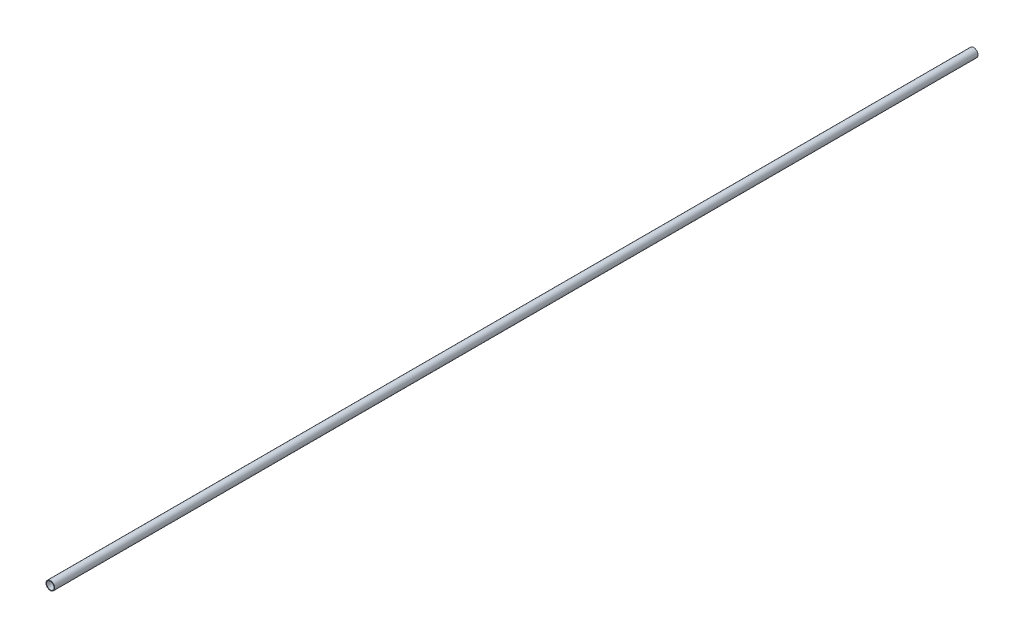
ISO-10303-21;
HEADER;
FILE_DESCRIPTION(('STEP AP214'),'2;1');
FILE_NAME('part.step','',(''),(''),'','','');
FILE_SCHEMA(('AUTOMOTIVE_DESIGN { 1 0 10303 214 1 1 1 1 }'));
ENDSEC;
DATA;
#1=APPLICATION_CONTEXT('core data for automotive mechanical design processes');
#2=APPLICATION_PROTOCOL_DEFINITION('international standard','automotive_design',2000,#1);
#3=PRODUCT_CONTEXT('',#1,'mechanical');
#4=PRODUCT('Part','Part','',(#3));
#5=PRODUCT_RELATED_PRODUCT_CATEGORY('part','',(#4));
#6=PRODUCT_DEFINITION_FORMATION('','',#4);
#7=PRODUCT_DEFINITION_CONTEXT('part definition',#1,'design');
#8=PRODUCT_DEFINITION('design','',#6,#7);
#9=PRODUCT_DEFINITION_SHAPE('','',#8);
#10=(LENGTH_UNIT() NAMED_UNIT(*) SI_UNIT(.MILLI.,.METRE.));
#11=(NAMED_UNIT(*) PLANE_ANGLE_UNIT() SI_UNIT($,.RADIAN.));
#12=(NAMED_UNIT(*) SI_UNIT($,.STERADIAN.) SOLID_ANGLE_UNIT());
#13=UNCERTAINTY_MEASURE_WITH_UNIT(LENGTH_MEASURE(1.E-05),#10,'distance_accuracy_value','');
#14=(GEOMETRIC_REPRESENTATION_CONTEXT(3) GLOBAL_UNCERTAINTY_ASSIGNED_CONTEXT((#13)) GLOBAL_UNIT_ASSIGNED_CONTEXT((#10,
#11,#12)) REPRESENTATION_CONTEXT('',''));
#15=CARTESIAN_POINT('',(0.,0.,0.));
#16=DIRECTION('',(0.,0.,1.));
#17=DIRECTION('',(1.,0.,0.));
#18=AXIS2_PLACEMENT_3D('',#15,#16,#17);
#19=CARTESIAN_POINT('',(0.,0.,2032.));
#20=DIRECTION('',(0.,0.,1.));
#21=DIRECTION('',(1.,0.,0.));
#22=AXIS2_PLACEMENT_3D('',#19,#20,#21);
#23=PLANE('',#22);
#24=CARTESIAN_POINT('',(0.,0.,2032.));
#25=DIRECTION('',(0.,0.,1.));
#26=DIRECTION('',(1.,0.,0.));
#27=AXIS2_PLACEMENT_3D('',#24,#25,#26);
#28=CIRCLE('',#27,9.525);
#29=CARTESIAN_POINT('',(9.525,0.,2032.));
#30=VERTEX_POINT('',#29);
#31=EDGE_CURVE('E10',#30,#30,#28,.T.);
#32=ORIENTED_EDGE('',*,*,#31,.T.);
#33=EDGE_LOOP('',(#32));
#34=FACE_BOUND('',#33,.T.);
#35=CARTESIAN_POINT('',(0.,0.,2032.));
#36=DIRECTION('',(0.,0.,1.));
#37=DIRECTION('',(1.,0.,0.));
#38=AXIS2_PLACEMENT_3D('',#35,#36,#37);
#39=CIRCLE('',#38,8.255);
#40=CARTESIAN_POINT('',(8.255,0.,2032.));
#41=VERTEX_POINT('',#40);
#42=EDGE_CURVE('E54',#41,#41,#39,.T.);
#43=ORIENTED_EDGE('',*,*,#42,.F.);
#44=EDGE_LOOP('',(#43));
#45=FACE_BOUND('',#44,.T.);
#46=ADVANCED_FACE('F43',(#34,#45),#23,.T.);
#47=CARTESIAN_POINT('',(0.,0.,0.));
#48=DIRECTION('',(0.,0.,1.));
#49=DIRECTION('',(1.,0.,0.));
#50=AXIS2_PLACEMENT_3D('',#47,#48,#49);
#51=PLANE('',#50);
#52=CARTESIAN_POINT('',(0.,0.,0.));
#53=DIRECTION('',(0.,0.,1.));
#54=DIRECTION('',(1.,0.,0.));
#55=AXIS2_PLACEMENT_3D('',#52,#53,#54);
#56=CIRCLE('',#55,9.525);
#57=CARTESIAN_POINT('',(9.525,0.,0.));
#58=VERTEX_POINT('',#57);
#59=EDGE_CURVE('E47',#58,#58,#56,.T.);
#60=ORIENTED_EDGE('',*,*,#59,.F.);
#61=EDGE_LOOP('',(#60));
#62=FACE_BOUND('',#61,.T.);
#63=CARTESIAN_POINT('',(0.,0.,0.));
#64=DIRECTION('',(0.,0.,1.));
#65=DIRECTION('',(1.,0.,0.));
#66=AXIS2_PLACEMENT_3D('',#63,#64,#65);
#67=CIRCLE('',#66,8.255);
#68=CARTESIAN_POINT('',(8.255,0.,0.));
#69=VERTEX_POINT('',#68);
#70=EDGE_CURVE('E56',#69,#69,#67,.T.);
#71=ORIENTED_EDGE('',*,*,#70,.T.);
#72=EDGE_LOOP('',(#71));
#73=FACE_BOUND('',#72,.T.);
#74=ADVANCED_FACE('F66',(#62,#73),#51,.F.);
#75=CARTESIAN_POINT('',(0.,0.,2032.));
#76=DIRECTION('',(0.,0.,-1.));
#77=DIRECTION('',(-1.,0.,0.));
#78=AXIS2_PLACEMENT_3D('',#75,#76,#77);
#79=CYLINDRICAL_SURFACE('',#78,9.525);
#80=ORIENTED_EDGE('',*,*,#31,.F.);
#81=EDGE_LOOP('',(#80));
#82=FACE_BOUND('',#81,.T.);
#83=ORIENTED_EDGE('',*,*,#59,.T.);
#84=EDGE_LOOP('',(#83));
#85=FACE_BOUND('',#84,.T.);
#86=ADVANCED_FACE('F45',(#82,#85),#79,.T.);
#87=CARTESIAN_POINT('',(0.,0.,2032.));
#88=DIRECTION('',(0.,0.,-1.));
#89=DIRECTION('',(-1.,0.,0.));
#90=AXIS2_PLACEMENT_3D('',#87,#88,#89);
#91=CYLINDRICAL_SURFACE('',#90,8.255);
#92=ORIENTED_EDGE('',*,*,#42,.T.);
#93=EDGE_LOOP('',(#92));
#94=FACE_BOUND('',#93,.T.);
#95=ORIENTED_EDGE('',*,*,#70,.F.);
#96=EDGE_LOOP('',(#95));
#97=FACE_BOUND('',#96,.T.);
#98=ADVANCED_FACE('F62',(#94,#97),#91,.F.);
#99=CLOSED_SHELL('',(#46,#74,#86,#98));
#100=MANIFOLD_SOLID_BREP('B2',#99);
#101=ADVANCED_BREP_SHAPE_REPRESENTATION('',(#18,#100),#14);
#102=SHAPE_DEFINITION_REPRESENTATION(#9,#101);
ENDSEC;
END-ISO-10303-21;
